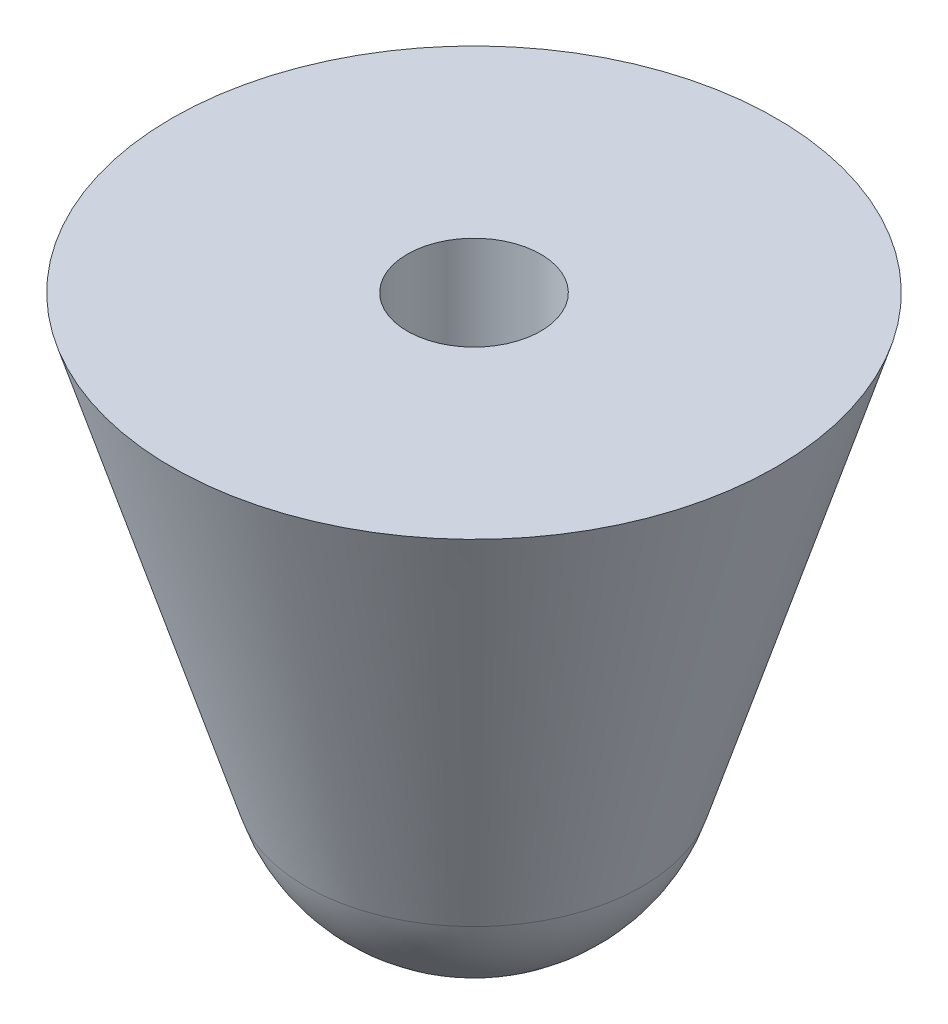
from build123d import *

# Parameters (mm, degrees)
SKETCH2_R          = 1.325
CUT_EXTRUDE1_DEPTH = 10


with BuildPart() as part:
    # Sketch1 → Revolve1 (revolve)
    with BuildSketch(Plane.XY):
        with BuildLine():
            Line((0, 0), (-6, 0))
            Line((-6, 0), (-3.341865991, -8.540159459))
            ThreePointArc((-3.341865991, -8.540159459), (-2.074782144, -10.318737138), (0, -11))
            Line((0, -11), (0, 0))
        make_face()
    revolve(axis=Axis((0, 0, 0), (0, -1, 0)))

    # Sketch2 → Cut-Extrude1 (cut)
    with BuildSketch(Plane(origin=(0, 0, 0), x_dir=(1, 0, 0), z_dir=(0, 1, 0))):
        with Locations(Location((0, 0, 0), (0, 0, 180))):
            Circle(SKETCH2_R)
    extrude(amount=-CUT_EXTRUDE1_DEPTH, mode=Mode.SUBTRACT)


solid = part.part
